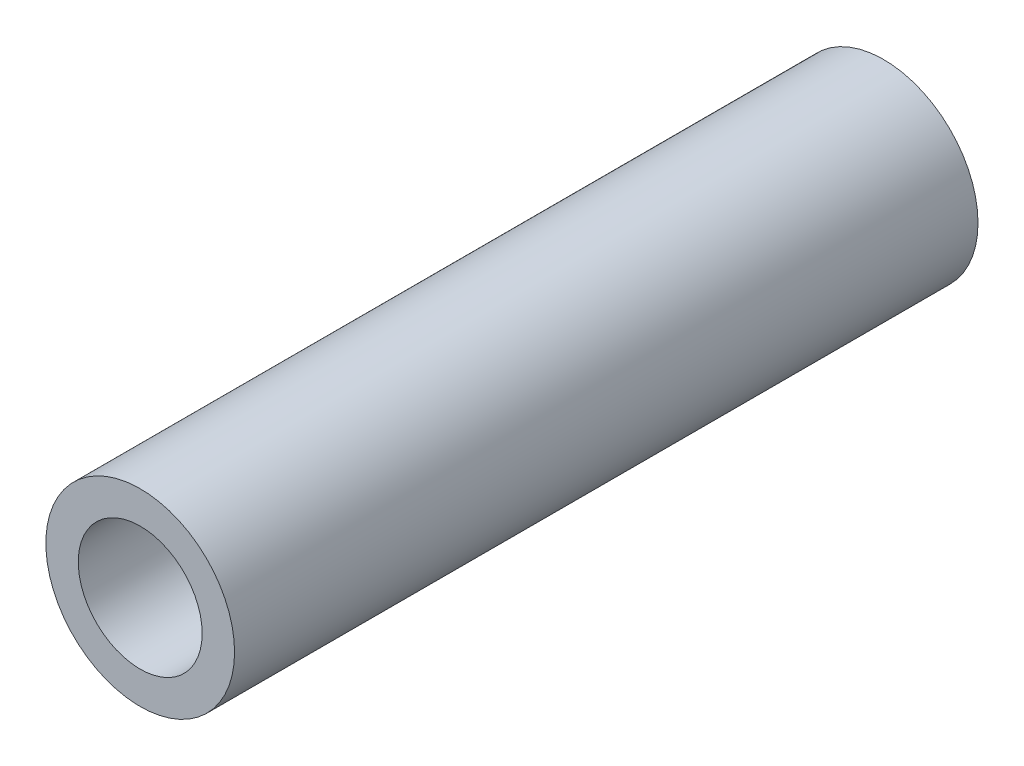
ISO-10303-21;
HEADER;
FILE_DESCRIPTION(('STEP AP214'),'2;1');
FILE_NAME('part.step','',(''),(''),'','','');
FILE_SCHEMA(('AUTOMOTIVE_DESIGN { 1 0 10303 214 1 1 1 1 }'));
ENDSEC;
DATA;
#1=APPLICATION_CONTEXT('core data for automotive mechanical design processes');
#2=APPLICATION_PROTOCOL_DEFINITION('international standard','automotive_design',2000,#1);
#3=PRODUCT_CONTEXT('',#1,'mechanical');
#4=PRODUCT('Part','Part','',(#3));
#5=PRODUCT_RELATED_PRODUCT_CATEGORY('part','',(#4));
#6=PRODUCT_DEFINITION_FORMATION('','',#4);
#7=PRODUCT_DEFINITION_CONTEXT('part definition',#1,'design');
#8=PRODUCT_DEFINITION('design','',#6,#7);
#9=PRODUCT_DEFINITION_SHAPE('','',#8);
#10=(LENGTH_UNIT() NAMED_UNIT(*) SI_UNIT(.MILLI.,.METRE.));
#11=(NAMED_UNIT(*) PLANE_ANGLE_UNIT() SI_UNIT($,.RADIAN.));
#12=(NAMED_UNIT(*) SI_UNIT($,.STERADIAN.) SOLID_ANGLE_UNIT());
#13=UNCERTAINTY_MEASURE_WITH_UNIT(LENGTH_MEASURE(1.E-05),#10,'distance_accuracy_value','');
#14=(GEOMETRIC_REPRESENTATION_CONTEXT(3) GLOBAL_UNCERTAINTY_ASSIGNED_CONTEXT((#13)) GLOBAL_UNIT_ASSIGNED_CONTEXT((#10,
#11,#12)) REPRESENTATION_CONTEXT('',''));
#15=CARTESIAN_POINT('',(0.,0.,0.));
#16=DIRECTION('',(0.,0.,1.));
#17=DIRECTION('',(1.,0.,0.));
#18=AXIS2_PLACEMENT_3D('',#15,#16,#17);
#19=CARTESIAN_POINT('',(0.,0.,39.));
#20=DIRECTION('',(0.,0.,1.));
#21=DIRECTION('',(1.,0.,0.));
#22=AXIS2_PLACEMENT_3D('',#19,#20,#21);
#23=PLANE('',#22);
#24=CARTESIAN_POINT('',(0.,0.,39.));
#25=DIRECTION('',(0.,0.,1.));
#26=DIRECTION('',(1.,0.,0.));
#27=AXIS2_PLACEMENT_3D('',#24,#25,#26);
#28=CIRCLE('',#27,4.95);
#29=CARTESIAN_POINT('',(4.95,0.,39.));
#30=VERTEX_POINT('',#29);
#31=EDGE_CURVE('E10',#30,#30,#28,.T.);
#32=ORIENTED_EDGE('',*,*,#31,.T.);
#33=EDGE_LOOP('',(#32));
#34=FACE_BOUND('',#33,.T.);
#35=CARTESIAN_POINT('',(0.,0.,39.));
#36=DIRECTION('',(0.,0.,1.));
#37=DIRECTION('',(1.,0.,0.));
#38=AXIS2_PLACEMENT_3D('',#35,#36,#37);
#39=CIRCLE('',#38,3.25);
#40=CARTESIAN_POINT('',(3.25,0.,39.));
#41=VERTEX_POINT('',#40);
#42=EDGE_CURVE('E42',#41,#41,#39,.T.);
#43=ORIENTED_EDGE('',*,*,#42,.F.);
#44=EDGE_LOOP('',(#43));
#45=FACE_BOUND('',#44,.T.);
#46=ADVANCED_FACE('F31',(#34,#45),#23,.T.);
#47=CARTESIAN_POINT('',(0.,0.,0.));
#48=DIRECTION('',(0.,0.,1.));
#49=DIRECTION('',(1.,0.,0.));
#50=AXIS2_PLACEMENT_3D('',#47,#48,#49);
#51=PLANE('',#50);
#52=CARTESIAN_POINT('',(0.,0.,0.));
#53=DIRECTION('',(0.,0.,1.));
#54=DIRECTION('',(1.,0.,0.));
#55=AXIS2_PLACEMENT_3D('',#52,#53,#54);
#56=CIRCLE('',#55,4.95);
#57=CARTESIAN_POINT('',(4.95,0.,0.));
#58=VERTEX_POINT('',#57);
#59=EDGE_CURVE('E35',#58,#58,#56,.T.);
#60=ORIENTED_EDGE('',*,*,#59,.F.);
#61=EDGE_LOOP('',(#60));
#62=FACE_BOUND('',#61,.T.);
#63=CARTESIAN_POINT('',(0.,0.,0.));
#64=DIRECTION('',(0.,0.,1.));
#65=DIRECTION('',(1.,0.,0.));
#66=AXIS2_PLACEMENT_3D('',#63,#64,#65);
#67=CIRCLE('',#66,3.25);
#68=CARTESIAN_POINT('',(3.25,0.,0.));
#69=VERTEX_POINT('',#68);
#70=EDGE_CURVE('E44',#69,#69,#67,.T.);
#71=ORIENTED_EDGE('',*,*,#70,.T.);
#72=EDGE_LOOP('',(#71));
#73=FACE_BOUND('',#72,.T.);
#74=ADVANCED_FACE('F54',(#62,#73),#51,.F.);
#75=CARTESIAN_POINT('',(0.,0.,39.));
#76=DIRECTION('',(0.,0.,-1.));
#77=DIRECTION('',(-1.,0.,0.));
#78=AXIS2_PLACEMENT_3D('',#75,#76,#77);
#79=CYLINDRICAL_SURFACE('',#78,4.95);
#80=ORIENTED_EDGE('',*,*,#31,.F.);
#81=EDGE_LOOP('',(#80));
#82=FACE_BOUND('',#81,.T.);
#83=ORIENTED_EDGE('',*,*,#59,.T.);
#84=EDGE_LOOP('',(#83));
#85=FACE_BOUND('',#84,.T.);
#86=ADVANCED_FACE('F33',(#82,#85),#79,.T.);
#87=CARTESIAN_POINT('',(0.,0.,39.));
#88=DIRECTION('',(0.,0.,-1.));
#89=DIRECTION('',(-1.,0.,0.));
#90=AXIS2_PLACEMENT_3D('',#87,#88,#89);
#91=CYLINDRICAL_SURFACE('',#90,3.25);
#92=ORIENTED_EDGE('',*,*,#42,.T.);
#93=EDGE_LOOP('',(#92));
#94=FACE_BOUND('',#93,.T.);
#95=ORIENTED_EDGE('',*,*,#70,.F.);
#96=EDGE_LOOP('',(#95));
#97=FACE_BOUND('',#96,.T.);
#98=ADVANCED_FACE('F50',(#94,#97),#91,.F.);
#99=CLOSED_SHELL('',(#46,#74,#86,#98));
#100=MANIFOLD_SOLID_BREP('B2',#99);
#101=ADVANCED_BREP_SHAPE_REPRESENTATION('',(#18,#100),#14);
#102=SHAPE_DEFINITION_REPRESENTATION(#9,#101);
ENDSEC;
END-ISO-10303-21;
